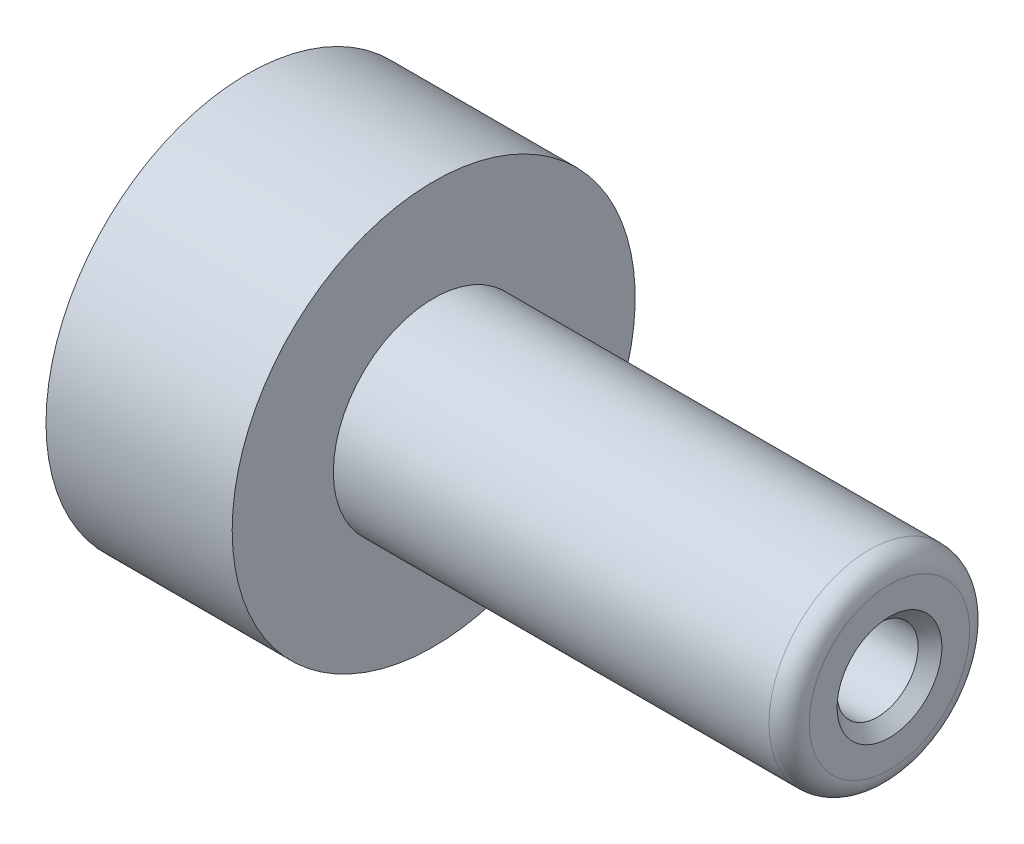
ISO-10303-21;
HEADER;
FILE_DESCRIPTION(('STEP AP214'),'2;1');
FILE_NAME('part.step','',(''),(''),'','','');
FILE_SCHEMA(('AUTOMOTIVE_DESIGN { 1 0 10303 214 1 1 1 1 }'));
ENDSEC;
DATA;
#1=APPLICATION_CONTEXT('core data for automotive mechanical design processes');
#2=APPLICATION_PROTOCOL_DEFINITION('international standard','automotive_design',2000,#1);
#3=PRODUCT_CONTEXT('',#1,'mechanical');
#4=PRODUCT('Part','Part','',(#3));
#5=PRODUCT_RELATED_PRODUCT_CATEGORY('part','',(#4));
#6=PRODUCT_DEFINITION_FORMATION('','',#4);
#7=PRODUCT_DEFINITION_CONTEXT('part definition',#1,'design');
#8=PRODUCT_DEFINITION('design','',#6,#7);
#9=PRODUCT_DEFINITION_SHAPE('','',#8);
#10=(LENGTH_UNIT() NAMED_UNIT(*) SI_UNIT(.MILLI.,.METRE.));
#11=(NAMED_UNIT(*) PLANE_ANGLE_UNIT() SI_UNIT($,.RADIAN.));
#12=(NAMED_UNIT(*) SI_UNIT($,.STERADIAN.) SOLID_ANGLE_UNIT());
#13=UNCERTAINTY_MEASURE_WITH_UNIT(LENGTH_MEASURE(1.E-05),#10,'distance_accuracy_value','');
#14=(GEOMETRIC_REPRESENTATION_CONTEXT(3) GLOBAL_UNCERTAINTY_ASSIGNED_CONTEXT((#13)) GLOBAL_UNIT_ASSIGNED_CONTEXT((#10,
#11,#12)) REPRESENTATION_CONTEXT('',''));
#15=CARTESIAN_POINT('',(0.,0.,0.));
#16=DIRECTION('',(0.,0.,1.));
#17=DIRECTION('',(1.,0.,0.));
#18=AXIS2_PLACEMENT_3D('',#15,#16,#17);
#19=CARTESIAN_POINT('',(0.,0.,0.));
#20=DIRECTION('',(-1.,0.,0.));
#21=DIRECTION('',(0.,0.,1.));
#22=AXIS2_PLACEMENT_3D('',#19,#20,#21);
#23=CYLINDRICAL_SURFACE('',#22,3.9751);
#24=CARTESIAN_POINT('',(21.7678,0.,0.));
#25=DIRECTION('',(-1.,0.,0.));
#26=DIRECTION('',(0.,0.,1.));
#27=AXIS2_PLACEMENT_3D('',#24,#25,#26);
#28=CIRCLE('',#27,3.9751);
#29=CARTESIAN_POINT('',(21.7678,0.,3.9751));
#30=VERTEX_POINT('',#29);
#31=EDGE_CURVE('E46',#30,#30,#28,.T.);
#32=ORIENTED_EDGE('',*,*,#31,.F.);
#33=EDGE_LOOP('',(#32));
#34=FACE_BOUND('',#33,.T.);
#35=CARTESIAN_POINT('',(0.,0.,0.));
#36=DIRECTION('',(-1.,0.,0.));
#37=DIRECTION('',(0.,0.,1.));
#38=AXIS2_PLACEMENT_3D('',#35,#36,#37);
#39=CIRCLE('',#38,3.9751);
#40=CARTESIAN_POINT('',(0.,0.,3.9751));
#41=VERTEX_POINT('',#40);
#42=EDGE_CURVE('E67',#41,#41,#39,.T.);
#43=ORIENTED_EDGE('',*,*,#42,.T.);
#44=EDGE_LOOP('',(#43));
#45=FACE_BOUND('',#44,.T.);
#46=ADVANCED_FACE('F35',(#34,#45),#23,.F.);
#47=CARTESIAN_POINT('',(21.7678,3.9751,0.));
#48=DIRECTION('',(1.,0.,0.));
#49=DIRECTION('',(0.,0.,-1.));
#50=AXIS2_PLACEMENT_3D('',#47,#48,#49);
#51=PLANE('',#50);
#52=ORIENTED_EDGE('',*,*,#31,.T.);
#53=EDGE_LOOP('',(#52));
#54=FACE_BOUND('',#53,.T.);
#55=ADVANCED_FACE('F101',(#54),#51,.F.);
#56=CARTESIAN_POINT('',(40.4622,5.0546,0.));
#57=DIRECTION('',(-1.,0.,0.));
#58=DIRECTION('',(0.,0.,1.));
#59=AXIS2_PLACEMENT_3D('',#56,#57,#58);
#60=PLANE('',#59);
#61=CARTESIAN_POINT('',(40.4622,0.,0.));
#62=DIRECTION('',(-1.,0.,0.));
#63=DIRECTION('',(0.,0.,1.));
#64=AXIS2_PLACEMENT_3D('',#61,#62,#63);
#65=CIRCLE('',#64,3.30199999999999);
#66=CARTESIAN_POINT('',(40.4622,0.,3.30199999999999));
#67=VERTEX_POINT('',#66);
#68=EDGE_CURVE('E10',#67,#67,#65,.T.);
#69=ORIENTED_EDGE('',*,*,#68,.T.);
#70=EDGE_LOOP('',(#69));
#71=FACE_BOUND('',#70,.T.);
#72=CARTESIAN_POINT('',(40.4622,0.,0.));
#73=DIRECTION('',(-1.,0.,0.));
#74=DIRECTION('',(0.,0.,1.));
#75=AXIS2_PLACEMENT_3D('',#72,#73,#74);
#76=CIRCLE('',#75,5.0546);
#77=CARTESIAN_POINT('',(40.4622,0.,5.0546));
#78=VERTEX_POINT('',#77);
#79=EDGE_CURVE('E50',#78,#78,#76,.T.);
#80=ORIENTED_EDGE('',*,*,#79,.F.);
#81=EDGE_LOOP('',(#80));
#82=FACE_BOUND('',#81,.T.);
#83=ADVANCED_FACE('F106',(#71,#82),#60,.F.);
#84=CARTESIAN_POINT('',(39.1922,0.,0.));
#85=DIRECTION('',(-1.,0.,0.));
#86=DIRECTION('',(0.,0.,1.));
#87=AXIS2_PLACEMENT_3D('',#84,#85,#86);
#88=TOROIDAL_SURFACE('',#87,5.0546,1.27);
#89=CARTESIAN_POINT('',(39.1922,0.,0.));
#90=DIRECTION('',(-1.,0.,0.));
#91=DIRECTION('',(0.,0.,1.));
#92=AXIS2_PLACEMENT_3D('',#89,#90,#91);
#93=CIRCLE('',#92,6.3246);
#94=CARTESIAN_POINT('',(39.1922,0.,6.3246));
#95=VERTEX_POINT('',#94);
#96=EDGE_CURVE('E55',#95,#95,#93,.T.);
#97=ORIENTED_EDGE('',*,*,#96,.F.);
#98=EDGE_LOOP('',(#97));
#99=FACE_BOUND('',#98,.T.);
#100=ORIENTED_EDGE('',*,*,#79,.T.);
#101=EDGE_LOOP('',(#100));
#102=FACE_BOUND('',#101,.T.);
#103=ADVANCED_FACE('F114',(#99,#102),#88,.T.);
#104=CARTESIAN_POINT('',(0.,0.,0.));
#105=DIRECTION('',(-1.,0.,0.));
#106=DIRECTION('',(0.,0.,1.));
#107=AXIS2_PLACEMENT_3D('',#104,#105,#106);
#108=CYLINDRICAL_SURFACE('',#107,6.3246);
#109=CARTESIAN_POINT('',(11.7348,0.,0.));
#110=DIRECTION('',(-1.,0.,0.));
#111=DIRECTION('',(0.,0.,1.));
#112=AXIS2_PLACEMENT_3D('',#109,#110,#111);
#113=CIRCLE('',#112,6.3246);
#114=CARTESIAN_POINT('',(11.7348,0.,6.3246));
#115=VERTEX_POINT('',#114);
#116=EDGE_CURVE('E58',#115,#115,#113,.T.);
#117=ORIENTED_EDGE('',*,*,#116,.F.);
#118=EDGE_LOOP('',(#117));
#119=FACE_BOUND('',#118,.T.);
#120=ORIENTED_EDGE('',*,*,#96,.T.);
#121=EDGE_LOOP('',(#120));
#122=FACE_BOUND('',#121,.T.);
#123=ADVANCED_FACE('F117',(#119,#122),#108,.T.);
#124=CARTESIAN_POINT('',(11.7348,12.7,0.));
#125=DIRECTION('',(-1.,0.,0.));
#126=DIRECTION('',(0.,0.,1.));
#127=AXIS2_PLACEMENT_3D('',#124,#125,#126);
#128=PLANE('',#127);
#129=CARTESIAN_POINT('',(11.7348,0.,0.));
#130=DIRECTION('',(-1.,0.,0.));
#131=DIRECTION('',(0.,0.,1.));
#132=AXIS2_PLACEMENT_3D('',#129,#130,#131);
#133=CIRCLE('',#132,12.7);
#134=CARTESIAN_POINT('',(11.7348,0.,12.7));
#135=VERTEX_POINT('',#134);
#136=EDGE_CURVE('E61',#135,#135,#133,.T.);
#137=ORIENTED_EDGE('',*,*,#136,.F.);
#138=EDGE_LOOP('',(#137));
#139=FACE_BOUND('',#138,.T.);
#140=ORIENTED_EDGE('',*,*,#116,.T.);
#141=EDGE_LOOP('',(#140));
#142=FACE_BOUND('',#141,.T.);
#143=ADVANCED_FACE('F121',(#139,#142),#128,.F.);
#144=CARTESIAN_POINT('',(0.,0.,0.));
#145=DIRECTION('',(-1.,0.,0.));
#146=DIRECTION('',(0.,0.,1.));
#147=AXIS2_PLACEMENT_3D('',#144,#145,#146);
#148=CYLINDRICAL_SURFACE('',#147,12.7);
#149=CARTESIAN_POINT('',(0.,0.,0.));
#150=DIRECTION('',(-1.,0.,0.));
#151=DIRECTION('',(0.,0.,1.));
#152=AXIS2_PLACEMENT_3D('',#149,#150,#151);
#153=CIRCLE('',#152,12.7);
#154=CARTESIAN_POINT('',(0.,0.,12.7));
#155=VERTEX_POINT('',#154);
#156=EDGE_CURVE('E64',#155,#155,#153,.T.);
#157=ORIENTED_EDGE('',*,*,#156,.F.);
#158=EDGE_LOOP('',(#157));
#159=FACE_BOUND('',#158,.T.);
#160=ORIENTED_EDGE('',*,*,#136,.T.);
#161=EDGE_LOOP('',(#160));
#162=FACE_BOUND('',#161,.T.);
#163=ADVANCED_FACE('F125',(#159,#162),#148,.T.);
#164=CARTESIAN_POINT('',(0.,3.9751,0.));
#165=DIRECTION('',(1.,0.,0.));
#166=DIRECTION('',(0.,0.,-1.));
#167=AXIS2_PLACEMENT_3D('',#164,#165,#166);
#168=PLANE('',#167);
#169=CARTESIAN_POINT('',(0.,-7.1374,0.));
#170=DIRECTION('',(-1.,0.,0.));
#171=DIRECTION('',(0.,0.,-1.));
#172=AXIS2_PLACEMENT_3D('',#169,#170,#171);
#173=CIRCLE('',#172,1.6129);
#174=CARTESIAN_POINT('',(0.,-7.1374,-1.6129));
#175=VERTEX_POINT('',#174);
#176=EDGE_CURVE('E77',#175,#175,#173,.T.);
#177=ORIENTED_EDGE('',*,*,#176,.F.);
#178=EDGE_LOOP('',(#177));
#179=FACE_BOUND('',#178,.T.);
#180=CARTESIAN_POINT('',(0.,7.1374,0.));
#181=DIRECTION('',(-1.,0.,0.));
#182=DIRECTION('',(0.,0.,1.));
#183=AXIS2_PLACEMENT_3D('',#180,#181,#182);
#184=CIRCLE('',#183,1.6129);
#185=CARTESIAN_POINT('',(0.,7.1374,1.6129));
#186=VERTEX_POINT('',#185);
#187=EDGE_CURVE('E71',#186,#186,#184,.T.);
#188=ORIENTED_EDGE('',*,*,#187,.F.);
#189=EDGE_LOOP('',(#188));
#190=FACE_BOUND('',#189,.T.);
#191=ORIENTED_EDGE('',*,*,#42,.F.);
#192=EDGE_LOOP('',(#191));
#193=FACE_BOUND('',#192,.T.);
#194=ORIENTED_EDGE('',*,*,#156,.T.);
#195=EDGE_LOOP('',(#194));
#196=FACE_BOUND('',#195,.T.);
#197=ADVANCED_FACE('F129',(#179,#190,#193,#196),#168,.F.);
#198=CARTESIAN_POINT('',(6.35,7.1374,0.));
#199=DIRECTION('',(-1.,0.,0.));
#200=DIRECTION('',(0.,0.,1.));
#201=AXIS2_PLACEMENT_3D('',#198,#199,#200);
#202=CYLINDRICAL_SURFACE('',#201,1.6129);
#203=CARTESIAN_POINT('',(6.35,7.1374,0.));
#204=DIRECTION('',(-1.,0.,0.));
#205=DIRECTION('',(0.,0.,1.));
#206=AXIS2_PLACEMENT_3D('',#203,#204,#205);
#207=CIRCLE('',#206,1.6129);
#208=CARTESIAN_POINT('',(6.35,7.1374,1.6129));
#209=VERTEX_POINT('',#208);
#210=EDGE_CURVE('E70',#209,#209,#207,.T.);
#211=ORIENTED_EDGE('',*,*,#210,.F.);
#212=EDGE_LOOP('',(#211));
#213=FACE_BOUND('',#212,.T.);
#214=ORIENTED_EDGE('',*,*,#187,.T.);
#215=EDGE_LOOP('',(#214));
#216=FACE_BOUND('',#215,.T.);
#217=ADVANCED_FACE('F133',(#213,#216),#202,.F.);
#218=CARTESIAN_POINT('',(6.35,7.1374,0.));
#219=DIRECTION('',(-1.,0.,0.));
#220=DIRECTION('',(0.,0.,1.));
#221=AXIS2_PLACEMENT_3D('',#218,#219,#220);
#222=PLANE('',#221);
#223=ORIENTED_EDGE('',*,*,#210,.T.);
#224=EDGE_LOOP('',(#223));
#225=FACE_BOUND('',#224,.T.);
#226=ADVANCED_FACE('F137',(#225),#222,.T.);
#227=CARTESIAN_POINT('',(6.35,-7.1374,0.));
#228=DIRECTION('',(-1.,0.,0.));
#229=DIRECTION('',(0.,0.,1.));
#230=AXIS2_PLACEMENT_3D('',#227,#228,#229);
#231=CYLINDRICAL_SURFACE('',#230,1.6129);
#232=CARTESIAN_POINT('',(6.35,-7.1374,0.));
#233=DIRECTION('',(-1.,0.,0.));
#234=DIRECTION('',(0.,0.,-1.));
#235=AXIS2_PLACEMENT_3D('',#232,#233,#234);
#236=CIRCLE('',#235,1.6129);
#237=CARTESIAN_POINT('',(6.35,-7.1374,-1.6129));
#238=VERTEX_POINT('',#237);
#239=EDGE_CURVE('E74',#238,#238,#236,.T.);
#240=ORIENTED_EDGE('',*,*,#239,.F.);
#241=EDGE_LOOP('',(#240));
#242=FACE_BOUND('',#241,.T.);
#243=ORIENTED_EDGE('',*,*,#176,.T.);
#244=EDGE_LOOP('',(#243));
#245=FACE_BOUND('',#244,.T.);
#246=ADVANCED_FACE('F97',(#242,#245),#231,.F.);
#247=CARTESIAN_POINT('',(6.35,-7.1374,0.));
#248=DIRECTION('',(1.,0.,0.));
#249=DIRECTION('',(0.,0.,-1.));
#250=AXIS2_PLACEMENT_3D('',#247,#248,#249);
#251=PLANE('',#250);
#252=ORIENTED_EDGE('',*,*,#239,.T.);
#253=EDGE_LOOP('',(#252));
#254=FACE_BOUND('',#253,.T.);
#255=ADVANCED_FACE('F90',(#254),#251,.F.);
#256=CARTESIAN_POINT('',(24.6634,0.,0.));
#257=DIRECTION('',(1.,0.,0.));
#258=DIRECTION('',(0.,0.,-1.));
#259=AXIS2_PLACEMENT_3D('',#256,#257,#258);
#260=CYLINDRICAL_SURFACE('',#259,2.5527);
#261=CARTESIAN_POINT('',(39.7129,0.,0.));
#262=DIRECTION('',(-1.,0.,0.));
#263=DIRECTION('',(0.,0.,1.));
#264=AXIS2_PLACEMENT_3D('',#261,#262,#263);
#265=CIRCLE('',#264,2.5527);
#266=CARTESIAN_POINT('',(39.7129,0.,2.5527));
#267=VERTEX_POINT('',#266);
#268=EDGE_CURVE('E42',#267,#267,#265,.F.);
#269=ORIENTED_EDGE('',*,*,#268,.T.);
#270=EDGE_LOOP('',(#269));
#271=FACE_BOUND('',#270,.T.);
#272=CARTESIAN_POINT('',(24.6634,0.,0.));
#273=DIRECTION('',(1.,0.,0.));
#274=DIRECTION('',(0.,0.,-1.));
#275=AXIS2_PLACEMENT_3D('',#272,#273,#274);
#276=CIRCLE('',#275,2.5527);
#277=CARTESIAN_POINT('',(24.6634,0.,-2.5527));
#278=VERTEX_POINT('',#277);
#279=EDGE_CURVE('E80',#278,#278,#276,.T.);
#280=ORIENTED_EDGE('',*,*,#279,.F.);
#281=EDGE_LOOP('',(#280));
#282=FACE_BOUND('',#281,.T.);
#283=ADVANCED_FACE('F88',(#271,#282),#260,.F.);
#284=CARTESIAN_POINT('',(24.6634,0.,0.));
#285=DIRECTION('',(1.,0.,0.));
#286=DIRECTION('',(0.,0.,-1.));
#287=AXIS2_PLACEMENT_3D('',#284,#285,#286);
#288=PLANE('',#287);
#289=ORIENTED_EDGE('',*,*,#279,.T.);
#290=EDGE_LOOP('',(#289));
#291=FACE_BOUND('',#290,.T.);
#292=ADVANCED_FACE('F86',(#291),#288,.T.);
#293=CARTESIAN_POINT('',(39.7129,0.,0.));
#294=DIRECTION('',(1.,0.,0.));
#295=DIRECTION('',(0.,0.,-1.));
#296=AXIS2_PLACEMENT_3D('',#293,#294,#295);
#297=CONICAL_SURFACE('',#296,2.5527,0.785398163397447);
#298=ORIENTED_EDGE('',*,*,#68,.F.);
#299=EDGE_LOOP('',(#298));
#300=FACE_BOUND('',#299,.T.);
#301=ORIENTED_EDGE('',*,*,#268,.F.);
#302=EDGE_LOOP('',(#301));
#303=FACE_BOUND('',#302,.T.);
#304=ADVANCED_FACE('F37',(#300,#303),#297,.F.);
#305=CLOSED_SHELL('',(#46,#55,#83,#103,#123,#143,#163,#197,#217,#226,#246,#255,#283,#292,#304));
#306=MANIFOLD_SOLID_BREP('B2',#305);
#307=ADVANCED_BREP_SHAPE_REPRESENTATION('',(#18,#306),#14);
#308=SHAPE_DEFINITION_REPRESENTATION(#9,#307);
ENDSEC;
END-ISO-10303-21;
